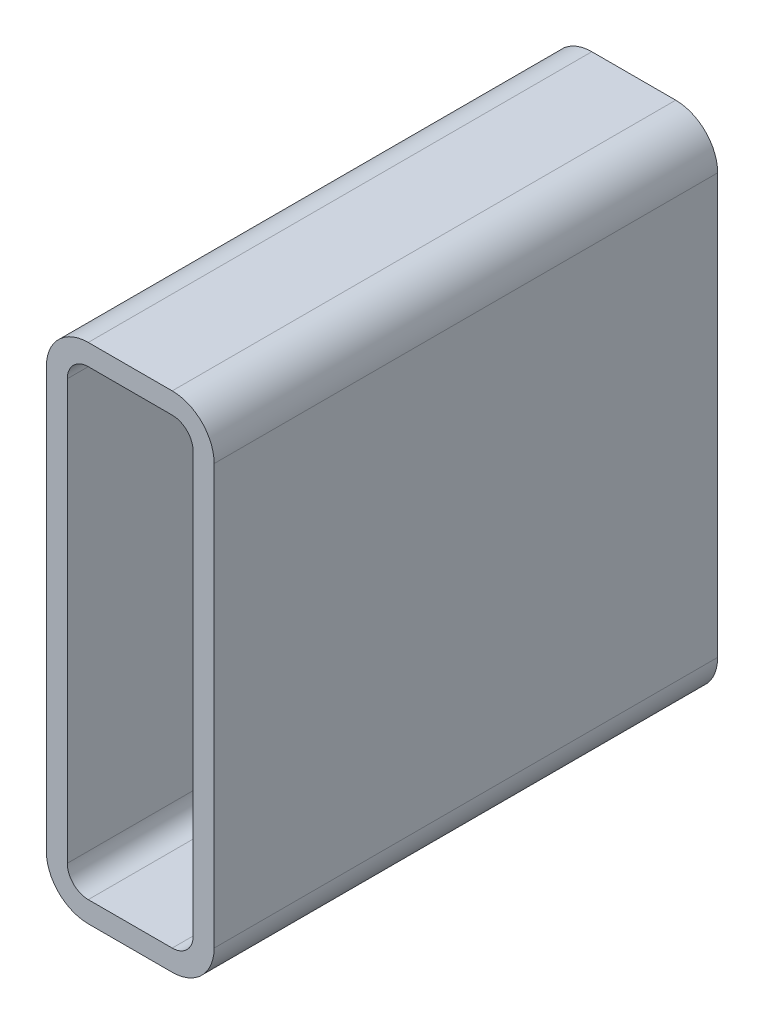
ISO-10303-21;
HEADER;
FILE_DESCRIPTION(('STEP AP214'),'2;1');
FILE_NAME('part.step','',(''),(''),'','','');
FILE_SCHEMA(('AUTOMOTIVE_DESIGN { 1 0 10303 214 1 1 1 1 }'));
ENDSEC;
DATA;
#1=APPLICATION_CONTEXT('core data for automotive mechanical design processes');
#2=APPLICATION_PROTOCOL_DEFINITION('international standard','automotive_design',2000,#1);
#3=PRODUCT_CONTEXT('',#1,'mechanical');
#4=PRODUCT('Part','Part','',(#3));
#5=PRODUCT_RELATED_PRODUCT_CATEGORY('part','',(#4));
#6=PRODUCT_DEFINITION_FORMATION('','',#4);
#7=PRODUCT_DEFINITION_CONTEXT('part definition',#1,'design');
#8=PRODUCT_DEFINITION('design','',#6,#7);
#9=PRODUCT_DEFINITION_SHAPE('','',#8);
#10=(LENGTH_UNIT() NAMED_UNIT(*) SI_UNIT(.MILLI.,.METRE.));
#11=(NAMED_UNIT(*) PLANE_ANGLE_UNIT() SI_UNIT($,.RADIAN.));
#12=(NAMED_UNIT(*) SI_UNIT($,.STERADIAN.) SOLID_ANGLE_UNIT());
#13=UNCERTAINTY_MEASURE_WITH_UNIT(LENGTH_MEASURE(1.E-05),#10,'distance_accuracy_value','');
#14=(GEOMETRIC_REPRESENTATION_CONTEXT(3) GLOBAL_UNCERTAINTY_ASSIGNED_CONTEXT((#13)) GLOBAL_UNIT_ASSIGNED_CONTEXT((#10,
#11,#12)) REPRESENTATION_CONTEXT('',''));
#15=CARTESIAN_POINT('',(0.,0.,0.));
#16=DIRECTION('',(0.,0.,1.));
#17=DIRECTION('',(1.,0.,0.));
#18=AXIS2_PLACEMENT_3D('',#15,#16,#17);
#19=CARTESIAN_POINT('',(27.0751778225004,281.274496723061,304.8));
#20=DIRECTION('',(0.,0.,1.));
#21=DIRECTION('',(1.,0.,0.));
#22=AXIS2_PLACEMENT_3D('',#19,#20,#21);
#23=PLANE('',#22);
#24=CARTESIAN_POINT('',(27.0751778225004,281.274496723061,304.8));
#25=DIRECTION('',(0.,0.,1.));
#26=DIRECTION('',(1.,0.,0.));
#27=AXIS2_PLACEMENT_3D('',#24,#25,#26);
#28=CIRCLE('',#27,25.4);
#29=CARTESIAN_POINT('',(27.0751778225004,306.674496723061,304.8));
#30=VERTEX_POINT('',#29);
#31=CARTESIAN_POINT('',(1.67517782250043,281.274496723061,304.8));
#32=VERTEX_POINT('',#31);
#33=EDGE_CURVE('E211',#30,#32,#28,.T.);
#34=ORIENTED_EDGE('',*,*,#33,.T.);
#35=DIRECTION('',(0.,-1.,0.));
#36=VECTOR('',#35,1.);
#37=CARTESIAN_POINT('',(1.67517782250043,27.2744967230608,304.8));
#38=LINE('',#37,#36);
#39=CARTESIAN_POINT('',(1.67517782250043,27.2744967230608,304.8));
#40=VERTEX_POINT('',#39);
#41=EDGE_CURVE('E214',#32,#40,#38,.T.);
#42=ORIENTED_EDGE('',*,*,#41,.T.);
#43=CARTESIAN_POINT('',(27.0751778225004,27.2744967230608,304.8));
#44=DIRECTION('',(0.,0.,1.));
#45=DIRECTION('',(1.,0.,0.));
#46=AXIS2_PLACEMENT_3D('',#43,#44,#45);
#47=CIRCLE('',#46,25.4);
#48=CARTESIAN_POINT('',(27.0751778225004,1.87449672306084,304.8));
#49=VERTEX_POINT('',#48);
#50=EDGE_CURVE('E217',#40,#49,#47,.T.);
#51=ORIENTED_EDGE('',*,*,#50,.T.);
#52=DIRECTION('',(1.,0.,0.));
#53=VECTOR('',#52,1.);
#54=CARTESIAN_POINT('',(77.8751778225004,1.87449672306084,304.8));
#55=LINE('',#54,#53);
#56=CARTESIAN_POINT('',(77.8751778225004,1.87449672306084,304.8));
#57=VERTEX_POINT('',#56);
#58=EDGE_CURVE('E219',#49,#57,#55,.T.);
#59=ORIENTED_EDGE('',*,*,#58,.T.);
#60=CARTESIAN_POINT('',(77.8751778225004,27.2744967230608,304.8));
#61=DIRECTION('',(0.,0.,1.));
#62=DIRECTION('',(1.,0.,0.));
#63=AXIS2_PLACEMENT_3D('',#60,#61,#62);
#64=CIRCLE('',#63,25.4);
#65=CARTESIAN_POINT('',(103.2751778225,27.2744967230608,304.8));
#66=VERTEX_POINT('',#65);
#67=EDGE_CURVE('E221',#57,#66,#64,.T.);
#68=ORIENTED_EDGE('',*,*,#67,.T.);
#69=DIRECTION('',(0.,1.,0.));
#70=VECTOR('',#69,1.);
#71=CARTESIAN_POINT('',(103.2751778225,281.274496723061,304.8));
#72=LINE('',#71,#70);
#73=CARTESIAN_POINT('',(103.2751778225,281.274496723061,304.8));
#74=VERTEX_POINT('',#73);
#75=EDGE_CURVE('E223',#66,#74,#72,.T.);
#76=ORIENTED_EDGE('',*,*,#75,.T.);
#77=CARTESIAN_POINT('',(77.8751778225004,281.274496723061,304.8));
#78=DIRECTION('',(0.,0.,1.));
#79=DIRECTION('',(1.,0.,0.));
#80=AXIS2_PLACEMENT_3D('',#77,#78,#79);
#81=CIRCLE('',#80,25.4);
#82=CARTESIAN_POINT('',(77.8751778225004,306.674496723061,304.8));
#83=VERTEX_POINT('',#82);
#84=EDGE_CURVE('E225',#74,#83,#81,.T.);
#85=ORIENTED_EDGE('',*,*,#84,.T.);
#86=DIRECTION('',(-1.,0.,0.));
#87=VECTOR('',#86,1.);
#88=CARTESIAN_POINT('',(27.0751778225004,306.674496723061,304.8));
#89=LINE('',#88,#87);
#90=EDGE_CURVE('E227',#83,#30,#89,.T.);
#91=ORIENTED_EDGE('',*,*,#90,.T.);
#92=EDGE_LOOP('',(#34,#42,#51,#59,#68,#76,#85,#91));
#93=FACE_BOUND('',#92,.T.);
#94=DIRECTION('',(0.,-1.,0.));
#95=VECTOR('',#94,1.);
#96=CARTESIAN_POINT('',(14.3751778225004,27.2744967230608,304.8));
#97=LINE('',#96,#95);
#98=CARTESIAN_POINT('',(14.3751778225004,281.274496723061,304.8));
#99=VERTEX_POINT('',#98);
#100=CARTESIAN_POINT('',(14.3751778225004,27.2744967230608,304.8));
#101=VERTEX_POINT('',#100);
#102=EDGE_CURVE('E154',#99,#101,#97,.T.);
#103=ORIENTED_EDGE('',*,*,#102,.F.);
#104=CARTESIAN_POINT('',(27.0751778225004,281.274496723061,304.8));
#105=DIRECTION('',(0.,0.,1.));
#106=DIRECTION('',(1.,0.,0.));
#107=AXIS2_PLACEMENT_3D('',#104,#105,#106);
#108=CIRCLE('',#107,12.7);
#109=CARTESIAN_POINT('',(27.0751778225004,293.974496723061,304.8));
#110=VERTEX_POINT('',#109);
#111=EDGE_CURVE('E146',#110,#99,#108,.T.);
#112=ORIENTED_EDGE('',*,*,#111,.F.);
#113=DIRECTION('',(-1.,0.,0.));
#114=VECTOR('',#113,1.);
#115=CARTESIAN_POINT('',(27.0751778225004,293.974496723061,304.8));
#116=LINE('',#115,#114);
#117=CARTESIAN_POINT('',(77.8751778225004,293.974496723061,304.8));
#118=VERTEX_POINT('',#117);
#119=EDGE_CURVE('E179',#118,#110,#116,.T.);
#120=ORIENTED_EDGE('',*,*,#119,.F.);
#121=CARTESIAN_POINT('',(77.8751778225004,281.274496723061,304.8));
#122=DIRECTION('',(0.,0.,1.));
#123=DIRECTION('',(1.,0.,0.));
#124=AXIS2_PLACEMENT_3D('',#121,#122,#123);
#125=CIRCLE('',#124,12.7);
#126=CARTESIAN_POINT('',(90.5751778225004,281.274496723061,304.8));
#127=VERTEX_POINT('',#126);
#128=EDGE_CURVE('E177',#127,#118,#125,.T.);
#129=ORIENTED_EDGE('',*,*,#128,.F.);
#130=DIRECTION('',(0.,1.,0.));
#131=VECTOR('',#130,1.);
#132=CARTESIAN_POINT('',(90.5751778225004,281.274496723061,304.8));
#133=LINE('',#132,#131);
#134=CARTESIAN_POINT('',(90.5751778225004,27.2744967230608,304.8));
#135=VERTEX_POINT('',#134);
#136=EDGE_CURVE('E175',#135,#127,#133,.T.);
#137=ORIENTED_EDGE('',*,*,#136,.F.);
#138=CARTESIAN_POINT('',(77.8751778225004,27.2744967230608,304.8));
#139=DIRECTION('',(0.,0.,1.));
#140=DIRECTION('',(1.,0.,0.));
#141=AXIS2_PLACEMENT_3D('',#138,#139,#140);
#142=CIRCLE('',#141,12.7);
#143=CARTESIAN_POINT('',(77.8751778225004,14.5744967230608,304.8));
#144=VERTEX_POINT('',#143);
#145=EDGE_CURVE('E173',#144,#135,#142,.T.);
#146=ORIENTED_EDGE('',*,*,#145,.F.);
#147=DIRECTION('',(1.,0.,0.));
#148=VECTOR('',#147,1.);
#149=CARTESIAN_POINT('',(77.8751778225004,14.5744967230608,304.8));
#150=LINE('',#149,#148);
#151=CARTESIAN_POINT('',(27.0751778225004,14.5744967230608,304.8));
#152=VERTEX_POINT('',#151);
#153=EDGE_CURVE('E169',#152,#144,#150,.T.);
#154=ORIENTED_EDGE('',*,*,#153,.F.);
#155=CARTESIAN_POINT('',(27.0751778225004,27.2744967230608,304.8));
#156=DIRECTION('',(0.,0.,1.));
#157=DIRECTION('',(1.,0.,0.));
#158=AXIS2_PLACEMENT_3D('',#155,#156,#157);
#159=CIRCLE('',#158,12.7);
#160=EDGE_CURVE('E167',#101,#152,#159,.T.);
#161=ORIENTED_EDGE('',*,*,#160,.F.);
#162=EDGE_LOOP('',(#103,#112,#120,#129,#137,#146,#154,#161));
#163=FACE_BOUND('',#162,.T.);
#164=ADVANCED_FACE('F33',(#93,#163),#23,.T.);
#165=CARTESIAN_POINT('',(27.0751778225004,281.274496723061,0.));
#166=DIRECTION('',(0.,0.,1.));
#167=DIRECTION('',(1.,0.,0.));
#168=AXIS2_PLACEMENT_3D('',#165,#166,#167);
#169=PLANE('',#168);
#170=CARTESIAN_POINT('',(27.0751778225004,281.274496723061,0.));
#171=DIRECTION('',(0.,0.,1.));
#172=DIRECTION('',(1.,0.,0.));
#173=AXIS2_PLACEMENT_3D('',#170,#171,#172);
#174=CIRCLE('',#173,25.4);
#175=CARTESIAN_POINT('',(27.0751778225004,306.674496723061,0.));
#176=VERTEX_POINT('',#175);
#177=CARTESIAN_POINT('',(1.67517782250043,281.274496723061,0.));
#178=VERTEX_POINT('',#177);
#179=EDGE_CURVE('E162',#176,#178,#174,.T.);
#180=ORIENTED_EDGE('',*,*,#179,.F.);
#181=DIRECTION('',(-1.,0.,0.));
#182=VECTOR('',#181,1.);
#183=CARTESIAN_POINT('',(27.0751778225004,306.674496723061,0.));
#184=LINE('',#183,#182);
#185=CARTESIAN_POINT('',(77.8751778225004,306.674496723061,0.));
#186=VERTEX_POINT('',#185);
#187=EDGE_CURVE('E215',#186,#176,#184,.T.);
#188=ORIENTED_EDGE('',*,*,#187,.F.);
#189=CARTESIAN_POINT('',(77.8751778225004,281.274496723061,0.));
#190=DIRECTION('',(0.,0.,1.));
#191=DIRECTION('',(1.,0.,0.));
#192=AXIS2_PLACEMENT_3D('',#189,#190,#191);
#193=CIRCLE('',#192,25.4);
#194=CARTESIAN_POINT('',(103.2751778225,281.274496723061,0.));
#195=VERTEX_POINT('',#194);
#196=EDGE_CURVE('E242',#195,#186,#193,.T.);
#197=ORIENTED_EDGE('',*,*,#196,.F.);
#198=DIRECTION('',(0.,1.,0.));
#199=VECTOR('',#198,1.);
#200=CARTESIAN_POINT('',(103.2751778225,281.274496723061,0.));
#201=LINE('',#200,#199);
#202=CARTESIAN_POINT('',(103.2751778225,27.2744967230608,0.));
#203=VERTEX_POINT('',#202);
#204=EDGE_CURVE('E240',#203,#195,#201,.T.);
#205=ORIENTED_EDGE('',*,*,#204,.F.);
#206=CARTESIAN_POINT('',(77.8751778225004,27.2744967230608,0.));
#207=DIRECTION('',(0.,0.,1.));
#208=DIRECTION('',(1.,0.,0.));
#209=AXIS2_PLACEMENT_3D('',#206,#207,#208);
#210=CIRCLE('',#209,25.4);
#211=CARTESIAN_POINT('',(77.8751778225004,1.87449672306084,0.));
#212=VERTEX_POINT('',#211);
#213=EDGE_CURVE('E238',#212,#203,#210,.T.);
#214=ORIENTED_EDGE('',*,*,#213,.F.);
#215=DIRECTION('',(1.,0.,0.));
#216=VECTOR('',#215,1.);
#217=CARTESIAN_POINT('',(77.8751778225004,1.87449672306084,0.));
#218=LINE('',#217,#216);
#219=CARTESIAN_POINT('',(27.0751778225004,1.87449672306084,0.));
#220=VERTEX_POINT('',#219);
#221=EDGE_CURVE('E236',#220,#212,#218,.T.);
#222=ORIENTED_EDGE('',*,*,#221,.F.);
#223=CARTESIAN_POINT('',(27.0751778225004,27.2744967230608,0.));
#224=DIRECTION('',(0.,0.,1.));
#225=DIRECTION('',(1.,0.,0.));
#226=AXIS2_PLACEMENT_3D('',#223,#224,#225);
#227=CIRCLE('',#226,25.4);
#228=CARTESIAN_POINT('',(1.67517782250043,27.2744967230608,0.));
#229=VERTEX_POINT('',#228);
#230=EDGE_CURVE('E234',#229,#220,#227,.T.);
#231=ORIENTED_EDGE('',*,*,#230,.F.);
#232=DIRECTION('',(0.,-1.,0.));
#233=VECTOR('',#232,1.);
#234=CARTESIAN_POINT('',(1.67517782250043,27.2744967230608,0.));
#235=LINE('',#234,#233);
#236=EDGE_CURVE('E232',#178,#229,#235,.T.);
#237=ORIENTED_EDGE('',*,*,#236,.F.);
#238=EDGE_LOOP('',(#180,#188,#197,#205,#214,#222,#231,#237));
#239=FACE_BOUND('',#238,.T.);
#240=CARTESIAN_POINT('',(27.0751778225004,281.274496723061,0.));
#241=DIRECTION('',(0.,0.,1.));
#242=DIRECTION('',(1.,0.,0.));
#243=AXIS2_PLACEMENT_3D('',#240,#241,#242);
#244=CIRCLE('',#243,12.7);
#245=CARTESIAN_POINT('',(27.0751778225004,293.974496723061,0.));
#246=VERTEX_POINT('',#245);
#247=CARTESIAN_POINT('',(14.3751778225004,281.274496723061,0.));
#248=VERTEX_POINT('',#247);
#249=EDGE_CURVE('E56',#246,#248,#244,.T.);
#250=ORIENTED_EDGE('',*,*,#249,.T.);
#251=DIRECTION('',(0.,-1.,0.));
#252=VECTOR('',#251,1.);
#253=CARTESIAN_POINT('',(14.3751778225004,27.2744967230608,0.));
#254=LINE('',#253,#252);
#255=CARTESIAN_POINT('',(14.3751778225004,27.2744967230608,0.));
#256=VERTEX_POINT('',#255);
#257=EDGE_CURVE('E161',#248,#256,#254,.T.);
#258=ORIENTED_EDGE('',*,*,#257,.T.);
#259=CARTESIAN_POINT('',(27.0751778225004,27.2744967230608,0.));
#260=DIRECTION('',(0.,0.,1.));
#261=DIRECTION('',(1.,0.,0.));
#262=AXIS2_PLACEMENT_3D('',#259,#260,#261);
#263=CIRCLE('',#262,12.7);
#264=CARTESIAN_POINT('',(27.0751778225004,14.5744967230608,0.));
#265=VERTEX_POINT('',#264);
#266=EDGE_CURVE('E183',#256,#265,#263,.T.);
#267=ORIENTED_EDGE('',*,*,#266,.T.);
#268=DIRECTION('',(1.,0.,0.));
#269=VECTOR('',#268,1.);
#270=CARTESIAN_POINT('',(77.8751778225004,14.5744967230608,0.));
#271=LINE('',#270,#269);
#272=CARTESIAN_POINT('',(77.8751778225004,14.5744967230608,0.));
#273=VERTEX_POINT('',#272);
#274=EDGE_CURVE('E186',#265,#273,#271,.T.);
#275=ORIENTED_EDGE('',*,*,#274,.T.);
#276=CARTESIAN_POINT('',(77.8751778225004,27.2744967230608,0.));
#277=DIRECTION('',(0.,0.,1.));
#278=DIRECTION('',(1.,0.,0.));
#279=AXIS2_PLACEMENT_3D('',#276,#277,#278);
#280=CIRCLE('',#279,12.7);
#281=CARTESIAN_POINT('',(90.5751778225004,27.2744967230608,0.));
#282=VERTEX_POINT('',#281);
#283=EDGE_CURVE('E189',#273,#282,#280,.T.);
#284=ORIENTED_EDGE('',*,*,#283,.T.);
#285=DIRECTION('',(0.,1.,0.));
#286=VECTOR('',#285,1.);
#287=CARTESIAN_POINT('',(90.5751778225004,281.274496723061,0.));
#288=LINE('',#287,#286);
#289=CARTESIAN_POINT('',(90.5751778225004,281.274496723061,0.));
#290=VERTEX_POINT('',#289);
#291=EDGE_CURVE('E192',#282,#290,#288,.T.);
#292=ORIENTED_EDGE('',*,*,#291,.T.);
#293=CARTESIAN_POINT('',(77.8751778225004,281.274496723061,0.));
#294=DIRECTION('',(0.,0.,1.));
#295=DIRECTION('',(1.,0.,0.));
#296=AXIS2_PLACEMENT_3D('',#293,#294,#295);
#297=CIRCLE('',#296,12.7);
#298=CARTESIAN_POINT('',(77.8751778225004,293.974496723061,0.));
#299=VERTEX_POINT('',#298);
#300=EDGE_CURVE('E195',#290,#299,#297,.T.);
#301=ORIENTED_EDGE('',*,*,#300,.T.);
#302=DIRECTION('',(-1.,0.,0.));
#303=VECTOR('',#302,1.);
#304=CARTESIAN_POINT('',(27.0751778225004,293.974496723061,0.));
#305=LINE('',#304,#303);
#306=EDGE_CURVE('E155',#299,#246,#305,.T.);
#307=ORIENTED_EDGE('',*,*,#306,.T.);
#308=EDGE_LOOP('',(#250,#258,#267,#275,#284,#292,#301,#307));
#309=FACE_BOUND('',#308,.T.);
#310=ADVANCED_FACE('F272',(#239,#309),#169,.F.);
#311=CARTESIAN_POINT('',(27.0751778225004,281.274496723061,304.8));
#312=DIRECTION('',(0.,0.,-1.));
#313=DIRECTION('',(-1.,0.,0.));
#314=AXIS2_PLACEMENT_3D('',#311,#312,#313);
#315=CYLINDRICAL_SURFACE('',#314,25.4);
#316=ORIENTED_EDGE('',*,*,#179,.T.);
#317=DIRECTION('',(0.,0.,-1.));
#318=VECTOR('',#317,1.);
#319=CARTESIAN_POINT('',(1.67517782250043,281.274496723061,304.8));
#320=LINE('',#319,#318);
#321=EDGE_CURVE('E11',#32,#178,#320,.T.);
#322=ORIENTED_EDGE('',*,*,#321,.F.);
#323=ORIENTED_EDGE('',*,*,#33,.F.);
#324=DIRECTION('',(0.,0.,-1.));
#325=VECTOR('',#324,1.);
#326=CARTESIAN_POINT('',(27.0751778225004,306.674496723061,304.8));
#327=LINE('',#326,#325);
#328=EDGE_CURVE('E229',#30,#176,#327,.T.);
#329=ORIENTED_EDGE('',*,*,#328,.T.);
#330=EDGE_LOOP('',(#316,#322,#323,#329));
#331=FACE_BOUND('',#330,.T.);
#332=ADVANCED_FACE('F35',(#331),#315,.T.);
#333=CARTESIAN_POINT('',(1.67517782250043,27.2744967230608,304.8));
#334=DIRECTION('',(1.,0.,0.));
#335=DIRECTION('',(0.,0.,-1.));
#336=AXIS2_PLACEMENT_3D('',#333,#334,#335);
#337=PLANE('',#336);
#338=ORIENTED_EDGE('',*,*,#236,.T.);
#339=DIRECTION('',(0.,0.,-1.));
#340=VECTOR('',#339,1.);
#341=CARTESIAN_POINT('',(1.67517782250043,27.2744967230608,304.8));
#342=LINE('',#341,#340);
#343=EDGE_CURVE('E41',#40,#229,#342,.T.);
#344=ORIENTED_EDGE('',*,*,#343,.F.);
#345=ORIENTED_EDGE('',*,*,#41,.F.);
#346=ORIENTED_EDGE('',*,*,#321,.T.);
#347=EDGE_LOOP('',(#338,#344,#345,#346));
#348=FACE_BOUND('',#347,.T.);
#349=ADVANCED_FACE('F289',(#348),#337,.F.);
#350=CARTESIAN_POINT('',(27.0751778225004,27.2744967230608,304.8));
#351=DIRECTION('',(0.,0.,-1.));
#352=DIRECTION('',(-1.,0.,0.));
#353=AXIS2_PLACEMENT_3D('',#350,#351,#352);
#354=CYLINDRICAL_SURFACE('',#353,25.4);
#355=ORIENTED_EDGE('',*,*,#230,.T.);
#356=DIRECTION('',(0.,0.,-1.));
#357=VECTOR('',#356,1.);
#358=CARTESIAN_POINT('',(27.0751778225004,1.87449672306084,304.8));
#359=LINE('',#358,#357);
#360=EDGE_CURVE('E259',#49,#220,#359,.T.);
#361=ORIENTED_EDGE('',*,*,#360,.F.);
#362=ORIENTED_EDGE('',*,*,#50,.F.);
#363=ORIENTED_EDGE('',*,*,#343,.T.);
#364=EDGE_LOOP('',(#355,#361,#362,#363));
#365=FACE_BOUND('',#364,.T.);
#366=ADVANCED_FACE('F266',(#365),#354,.T.);
#367=CARTESIAN_POINT('',(77.8751778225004,1.87449672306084,304.8));
#368=DIRECTION('',(0.,1.,0.));
#369=DIRECTION('',(0.,0.,1.));
#370=AXIS2_PLACEMENT_3D('',#367,#368,#369);
#371=PLANE('',#370);
#372=ORIENTED_EDGE('',*,*,#221,.T.);
#373=DIRECTION('',(0.,0.,-1.));
#374=VECTOR('',#373,1.);
#375=CARTESIAN_POINT('',(77.8751778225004,1.87449672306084,304.8));
#376=LINE('',#375,#374);
#377=EDGE_CURVE('E256',#57,#212,#376,.T.);
#378=ORIENTED_EDGE('',*,*,#377,.F.);
#379=ORIENTED_EDGE('',*,*,#58,.F.);
#380=ORIENTED_EDGE('',*,*,#360,.T.);
#381=EDGE_LOOP('',(#372,#378,#379,#380));
#382=FACE_BOUND('',#381,.T.);
#383=ADVANCED_FACE('F278',(#382),#371,.F.);
#384=CARTESIAN_POINT('',(77.8751778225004,27.2744967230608,304.8));
#385=DIRECTION('',(0.,0.,-1.));
#386=DIRECTION('',(-1.,0.,0.));
#387=AXIS2_PLACEMENT_3D('',#384,#385,#386);
#388=CYLINDRICAL_SURFACE('',#387,25.4);
#389=ORIENTED_EDGE('',*,*,#213,.T.);
#390=DIRECTION('',(0.,0.,-1.));
#391=VECTOR('',#390,1.);
#392=CARTESIAN_POINT('',(103.2751778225,27.2744967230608,304.8));
#393=LINE('',#392,#391);
#394=EDGE_CURVE('E253',#66,#203,#393,.T.);
#395=ORIENTED_EDGE('',*,*,#394,.F.);
#396=ORIENTED_EDGE('',*,*,#67,.F.);
#397=ORIENTED_EDGE('',*,*,#377,.T.);
#398=EDGE_LOOP('',(#389,#395,#396,#397));
#399=FACE_BOUND('',#398,.T.);
#400=ADVANCED_FACE('F282',(#399),#388,.T.);
#401=CARTESIAN_POINT('',(103.2751778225,281.274496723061,304.8));
#402=DIRECTION('',(-1.,0.,0.));
#403=DIRECTION('',(0.,0.,1.));
#404=AXIS2_PLACEMENT_3D('',#401,#402,#403);
#405=PLANE('',#404);
#406=ORIENTED_EDGE('',*,*,#204,.T.);
#407=DIRECTION('',(0.,0.,-1.));
#408=VECTOR('',#407,1.);
#409=CARTESIAN_POINT('',(103.2751778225,281.274496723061,304.8));
#410=LINE('',#409,#408);
#411=EDGE_CURVE('E250',#74,#195,#410,.T.);
#412=ORIENTED_EDGE('',*,*,#411,.F.);
#413=ORIENTED_EDGE('',*,*,#75,.F.);
#414=ORIENTED_EDGE('',*,*,#394,.T.);
#415=EDGE_LOOP('',(#406,#412,#413,#414));
#416=FACE_BOUND('',#415,.T.);
#417=ADVANCED_FACE('F302',(#416),#405,.F.);
#418=CARTESIAN_POINT('',(77.8751778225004,281.274496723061,304.8));
#419=DIRECTION('',(0.,0.,-1.));
#420=DIRECTION('',(-1.,0.,0.));
#421=AXIS2_PLACEMENT_3D('',#418,#419,#420);
#422=CYLINDRICAL_SURFACE('',#421,25.4);
#423=ORIENTED_EDGE('',*,*,#196,.T.);
#424=DIRECTION('',(0.,0.,-1.));
#425=VECTOR('',#424,1.);
#426=CARTESIAN_POINT('',(77.8751778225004,306.674496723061,304.8));
#427=LINE('',#426,#425);
#428=EDGE_CURVE('E247',#83,#186,#427,.T.);
#429=ORIENTED_EDGE('',*,*,#428,.F.);
#430=ORIENTED_EDGE('',*,*,#84,.F.);
#431=ORIENTED_EDGE('',*,*,#411,.T.);
#432=EDGE_LOOP('',(#423,#429,#430,#431));
#433=FACE_BOUND('',#432,.T.);
#434=ADVANCED_FACE('F300',(#433),#422,.T.);
#435=CARTESIAN_POINT('',(27.0751778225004,306.674496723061,304.8));
#436=DIRECTION('',(0.,-1.,0.));
#437=DIRECTION('',(0.,0.,-1.));
#438=AXIS2_PLACEMENT_3D('',#435,#436,#437);
#439=PLANE('',#438);
#440=ORIENTED_EDGE('',*,*,#187,.T.);
#441=ORIENTED_EDGE('',*,*,#328,.F.);
#442=ORIENTED_EDGE('',*,*,#90,.F.);
#443=ORIENTED_EDGE('',*,*,#428,.T.);
#444=EDGE_LOOP('',(#440,#441,#442,#443));
#445=FACE_BOUND('',#444,.T.);
#446=ADVANCED_FACE('F295',(#445),#439,.F.);
#447=CARTESIAN_POINT('',(27.0751778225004,281.274496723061,304.8));
#448=DIRECTION('',(0.,0.,-1.));
#449=DIRECTION('',(-1.,0.,0.));
#450=AXIS2_PLACEMENT_3D('',#447,#448,#449);
#451=CYLINDRICAL_SURFACE('',#450,12.7);
#452=ORIENTED_EDGE('',*,*,#249,.F.);
#453=DIRECTION('',(0.,0.,-1.));
#454=VECTOR('',#453,1.);
#455=CARTESIAN_POINT('',(27.0751778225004,293.974496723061,304.8));
#456=LINE('',#455,#454);
#457=EDGE_CURVE('E150',#110,#246,#456,.T.);
#458=ORIENTED_EDGE('',*,*,#457,.F.);
#459=ORIENTED_EDGE('',*,*,#111,.T.);
#460=DIRECTION('',(0.,0.,-1.));
#461=VECTOR('',#460,1.);
#462=CARTESIAN_POINT('',(14.3751778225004,281.274496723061,304.8));
#463=LINE('',#462,#461);
#464=EDGE_CURVE('E149',#99,#248,#463,.T.);
#465=ORIENTED_EDGE('',*,*,#464,.T.);
#466=EDGE_LOOP('',(#452,#458,#459,#465));
#467=FACE_BOUND('',#466,.T.);
#468=ADVANCED_FACE('F148',(#467),#451,.F.);
#469=CARTESIAN_POINT('',(14.3751778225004,27.2744967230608,304.8));
#470=DIRECTION('',(1.,0.,0.));
#471=DIRECTION('',(0.,0.,-1.));
#472=AXIS2_PLACEMENT_3D('',#469,#470,#471);
#473=PLANE('',#472);
#474=ORIENTED_EDGE('',*,*,#257,.F.);
#475=ORIENTED_EDGE('',*,*,#464,.F.);
#476=ORIENTED_EDGE('',*,*,#102,.T.);
#477=DIRECTION('',(0.,0.,-1.));
#478=VECTOR('',#477,1.);
#479=CARTESIAN_POINT('',(14.3751778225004,27.2744967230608,304.8));
#480=LINE('',#479,#478);
#481=EDGE_CURVE('E163',#101,#256,#480,.T.);
#482=ORIENTED_EDGE('',*,*,#481,.T.);
#483=EDGE_LOOP('',(#474,#475,#476,#482));
#484=FACE_BOUND('',#483,.T.);
#485=ADVANCED_FACE('F158',(#484),#473,.T.);
#486=CARTESIAN_POINT('',(27.0751778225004,27.2744967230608,304.8));
#487=DIRECTION('',(0.,0.,-1.));
#488=DIRECTION('',(-1.,0.,0.));
#489=AXIS2_PLACEMENT_3D('',#486,#487,#488);
#490=CYLINDRICAL_SURFACE('',#489,12.7);
#491=ORIENTED_EDGE('',*,*,#266,.F.);
#492=ORIENTED_EDGE('',*,*,#481,.F.);
#493=ORIENTED_EDGE('',*,*,#160,.T.);
#494=DIRECTION('',(0.,0.,-1.));
#495=VECTOR('',#494,1.);
#496=CARTESIAN_POINT('',(27.0751778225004,14.5744967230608,304.8));
#497=LINE('',#496,#495);
#498=EDGE_CURVE('E208',#152,#265,#497,.T.);
#499=ORIENTED_EDGE('',*,*,#498,.T.);
#500=EDGE_LOOP('',(#491,#492,#493,#499));
#501=FACE_BOUND('',#500,.T.);
#502=ADVANCED_FACE('F327',(#501),#490,.F.);
#503=CARTESIAN_POINT('',(77.8751778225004,14.5744967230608,304.8));
#504=DIRECTION('',(0.,1.,0.));
#505=DIRECTION('',(0.,0.,1.));
#506=AXIS2_PLACEMENT_3D('',#503,#504,#505);
#507=PLANE('',#506);
#508=ORIENTED_EDGE('',*,*,#274,.F.);
#509=ORIENTED_EDGE('',*,*,#498,.F.);
#510=ORIENTED_EDGE('',*,*,#153,.T.);
#511=DIRECTION('',(0.,0.,-1.));
#512=VECTOR('',#511,1.);
#513=CARTESIAN_POINT('',(77.8751778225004,14.5744967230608,304.8));
#514=LINE('',#513,#512);
#515=EDGE_CURVE('E206',#144,#273,#514,.T.);
#516=ORIENTED_EDGE('',*,*,#515,.T.);
#517=EDGE_LOOP('',(#508,#509,#510,#516));
#518=FACE_BOUND('',#517,.T.);
#519=ADVANCED_FACE('F331',(#518),#507,.T.);
#520=CARTESIAN_POINT('',(77.8751778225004,27.2744967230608,304.8));
#521=DIRECTION('',(0.,0.,-1.));
#522=DIRECTION('',(-1.,0.,0.));
#523=AXIS2_PLACEMENT_3D('',#520,#521,#522);
#524=CYLINDRICAL_SURFACE('',#523,12.7);
#525=ORIENTED_EDGE('',*,*,#283,.F.);
#526=ORIENTED_EDGE('',*,*,#515,.F.);
#527=ORIENTED_EDGE('',*,*,#145,.T.);
#528=DIRECTION('',(0.,0.,-1.));
#529=VECTOR('',#528,1.);
#530=CARTESIAN_POINT('',(90.5751778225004,27.2744967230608,304.8));
#531=LINE('',#530,#529);
#532=EDGE_CURVE('E204',#135,#282,#531,.T.);
#533=ORIENTED_EDGE('',*,*,#532,.T.);
#534=EDGE_LOOP('',(#525,#526,#527,#533));
#535=FACE_BOUND('',#534,.T.);
#536=ADVANCED_FACE('F337',(#535),#524,.F.);
#537=CARTESIAN_POINT('',(90.5751778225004,281.274496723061,304.8));
#538=DIRECTION('',(-1.,0.,0.));
#539=DIRECTION('',(0.,0.,1.));
#540=AXIS2_PLACEMENT_3D('',#537,#538,#539);
#541=PLANE('',#540);
#542=ORIENTED_EDGE('',*,*,#291,.F.);
#543=ORIENTED_EDGE('',*,*,#532,.F.);
#544=ORIENTED_EDGE('',*,*,#136,.T.);
#545=DIRECTION('',(0.,0.,-1.));
#546=VECTOR('',#545,1.);
#547=CARTESIAN_POINT('',(90.5751778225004,281.274496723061,304.8));
#548=LINE('',#547,#546);
#549=EDGE_CURVE('E202',#127,#290,#548,.T.);
#550=ORIENTED_EDGE('',*,*,#549,.T.);
#551=EDGE_LOOP('',(#542,#543,#544,#550));
#552=FACE_BOUND('',#551,.T.);
#553=ADVANCED_FACE('F341',(#552),#541,.T.);
#554=CARTESIAN_POINT('',(77.8751778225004,281.274496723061,304.8));
#555=DIRECTION('',(0.,0.,-1.));
#556=DIRECTION('',(-1.,0.,0.));
#557=AXIS2_PLACEMENT_3D('',#554,#555,#556);
#558=CYLINDRICAL_SURFACE('',#557,12.7);
#559=ORIENTED_EDGE('',*,*,#300,.F.);
#560=ORIENTED_EDGE('',*,*,#549,.F.);
#561=ORIENTED_EDGE('',*,*,#128,.T.);
#562=DIRECTION('',(0.,0.,-1.));
#563=VECTOR('',#562,1.);
#564=CARTESIAN_POINT('',(77.8751778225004,293.974496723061,304.8));
#565=LINE('',#564,#563);
#566=EDGE_CURVE('E48',#118,#299,#565,.T.);
#567=ORIENTED_EDGE('',*,*,#566,.T.);
#568=EDGE_LOOP('',(#559,#560,#561,#567));
#569=FACE_BOUND('',#568,.T.);
#570=ADVANCED_FACE('F345',(#569),#558,.F.);
#571=CARTESIAN_POINT('',(27.0751778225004,293.974496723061,304.8));
#572=DIRECTION('',(0.,-1.,0.));
#573=DIRECTION('',(0.,0.,-1.));
#574=AXIS2_PLACEMENT_3D('',#571,#572,#573);
#575=PLANE('',#574);
#576=ORIENTED_EDGE('',*,*,#306,.F.);
#577=ORIENTED_EDGE('',*,*,#566,.F.);
#578=ORIENTED_EDGE('',*,*,#119,.T.);
#579=ORIENTED_EDGE('',*,*,#457,.T.);
#580=EDGE_LOOP('',(#576,#577,#578,#579));
#581=FACE_BOUND('',#580,.T.);
#582=ADVANCED_FACE('F349',(#581),#575,.T.);
#583=CLOSED_SHELL('',(#164,#310,#332,#349,#366,#383,#400,#417,#434,#446,#468,#485,#502,#519,
#536,#553,#570,#582));
#584=MANIFOLD_SOLID_BREP('B2',#583);
#585=ADVANCED_BREP_SHAPE_REPRESENTATION('',(#18,#584),#14);
#586=SHAPE_DEFINITION_REPRESENTATION(#9,#585);
ENDSEC;
END-ISO-10303-21;
